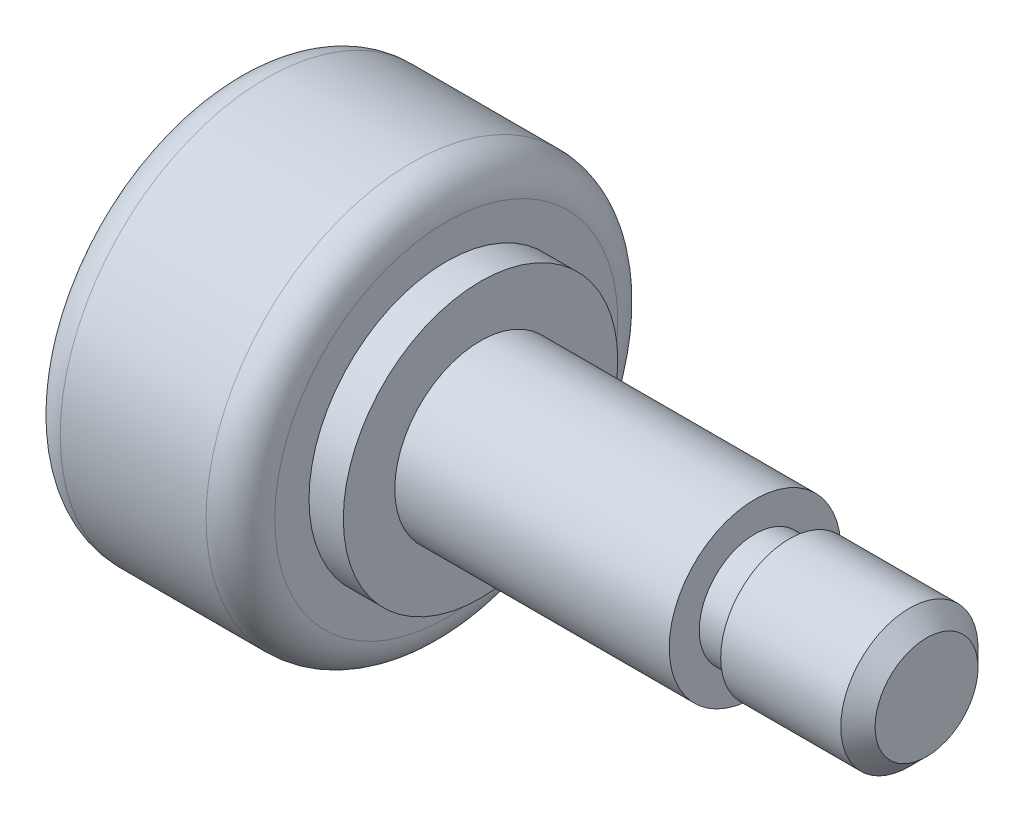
from build123d import *

# Parameters (mm, degrees)
FILLET_1_R     = 2
CHAMFER_1_SIZE = 1


with BuildPart() as part:
    # Sketch 1 → Revolve 1 (revolve)
    with BuildSketch(Plane.XY, mode=Mode.PRIVATE) as revolve_1_sk:
        with BuildLine():
            Line((0, 0), (0, 4))
            Line((0, 4), (-8, 4))
            Line((-8, 4), (-8, 3.25))
            Line((-8, 3.25), (-10, 3.25))
            Line((-10, 3.25), (-10, 5))
            Line((-10, 5), (-26, 5))
            Line((-26, 5), (-26, 8))
            Line((-26, 8), (-28, 8))
            Line((-28, 8), (-28, 12))
            Line((-28, 12), (-40, 12))
            ThreePointArc((-40, 12), (-41.379140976, 6.070307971), (-41.842431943, 0))
            Line((-41.842431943, 0), (0, 0))
        make_face()
    revolve(revolve_1_sk.sketch.rotate(Axis((-41.842431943, 0, 0), (1, 0, 0)), 90), axis=Axis((-41.842431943, 0, 0), (1, 0, 0)))

    # Fillet 1
    fillet_1_edges = [part.edges().sort_by_distance(p)[0] for p in [
        (-40, 0, -12),
        (-28, 0, -12),
    ]]
    fillet(fillet_1_edges, radius=FILLET_1_R)

    # Chamfer 1
    chamfer_1_edges = [part.edges().sort_by_distance(p)[0] for p in [
        (0, 0, -4),
    ]]
    chamfer(chamfer_1_edges, length=CHAMFER_1_SIZE)


solid = part.part
